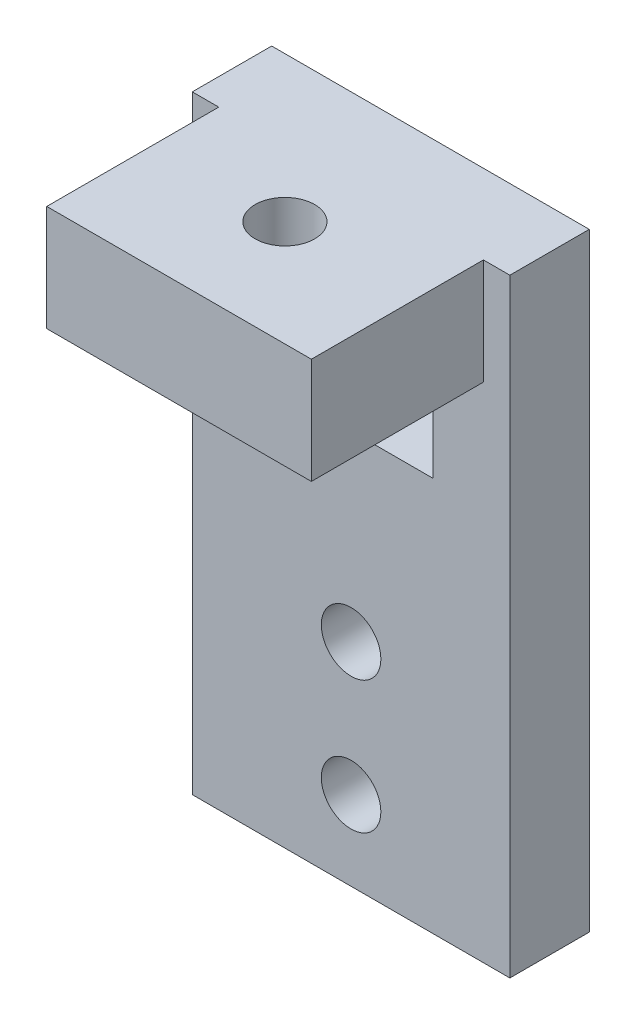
ISO-10303-21;
HEADER;
FILE_DESCRIPTION(('STEP AP214'),'2;1');
FILE_NAME('part.step','',(''),(''),'','','');
FILE_SCHEMA(('AUTOMOTIVE_DESIGN { 1 0 10303 214 1 1 1 1 }'));
ENDSEC;
DATA;
#1=APPLICATION_CONTEXT('core data for automotive mechanical design processes');
#2=APPLICATION_PROTOCOL_DEFINITION('international standard','automotive_design',2000,#1);
#3=PRODUCT_CONTEXT('',#1,'mechanical');
#4=PRODUCT('Part','Part','',(#3));
#5=PRODUCT_RELATED_PRODUCT_CATEGORY('part','',(#4));
#6=PRODUCT_DEFINITION_FORMATION('','',#4);
#7=PRODUCT_DEFINITION_CONTEXT('part definition',#1,'design');
#8=PRODUCT_DEFINITION('design','',#6,#7);
#9=PRODUCT_DEFINITION_SHAPE('','',#8);
#10=(LENGTH_UNIT() NAMED_UNIT(*) SI_UNIT(.MILLI.,.METRE.));
#11=(NAMED_UNIT(*) PLANE_ANGLE_UNIT() SI_UNIT($,.RADIAN.));
#12=(NAMED_UNIT(*) SI_UNIT($,.STERADIAN.) SOLID_ANGLE_UNIT());
#13=UNCERTAINTY_MEASURE_WITH_UNIT(LENGTH_MEASURE(1.E-05),#10,'distance_accuracy_value','');
#14=(GEOMETRIC_REPRESENTATION_CONTEXT(3) GLOBAL_UNCERTAINTY_ASSIGNED_CONTEXT((#13)) GLOBAL_UNIT_ASSIGNED_CONTEXT((#10,
#11,#12)) REPRESENTATION_CONTEXT('',''));
#15=CARTESIAN_POINT('',(0.,0.,0.));
#16=DIRECTION('',(0.,0.,1.));
#17=DIRECTION('',(1.,0.,0.));
#18=AXIS2_PLACEMENT_3D('',#15,#16,#17);
#19=CARTESIAN_POINT('',(0.,0.,6.));
#20=DIRECTION('',(0.,0.,1.));
#21=DIRECTION('',(1.,0.,0.));
#22=AXIS2_PLACEMENT_3D('',#19,#20,#21);
#23=PLANE('',#22);
#24=CARTESIAN_POINT('',(0.,-32.,6.));
#25=DIRECTION('',(0.,0.,1.));
#26=DIRECTION('',(1.,0.,0.));
#27=AXIS2_PLACEMENT_3D('',#24,#25,#26);
#28=CIRCLE('',#27,2.25);
#29=CARTESIAN_POINT('',(2.25,-32.,6.));
#30=VERTEX_POINT('',#29);
#31=EDGE_CURVE('E180',#30,#30,#28,.T.);
#32=ORIENTED_EDGE('',*,*,#31,.F.);
#33=EDGE_LOOP('',(#32));
#34=FACE_BOUND('',#33,.T.);
#35=CARTESIAN_POINT('',(0.,-22.,6.));
#36=DIRECTION('',(0.,0.,1.));
#37=DIRECTION('',(1.,0.,0.));
#38=AXIS2_PLACEMENT_3D('',#35,#36,#37);
#39=CIRCLE('',#38,2.25);
#40=CARTESIAN_POINT('',(2.25,-22.,6.));
#41=VERTEX_POINT('',#40);
#42=EDGE_CURVE('E171',#41,#41,#39,.T.);
#43=ORIENTED_EDGE('',*,*,#42,.F.);
#44=EDGE_LOOP('',(#43));
#45=FACE_BOUND('',#44,.T.);
#46=DIRECTION('',(0.,-1.,0.));
#47=VECTOR('',#46,1.);
#48=CARTESIAN_POINT('',(-6.2,0.2,6.));
#49=LINE('',#48,#47);
#50=CARTESIAN_POINT('',(-6.2,0.,6.));
#51=VERTEX_POINT('',#50);
#52=CARTESIAN_POINT('',(-6.2,-8.2,6.));
#53=VERTEX_POINT('',#52);
#54=EDGE_CURVE('E189',#51,#53,#49,.T.);
#55=ORIENTED_EDGE('',*,*,#54,.F.);
#56=DIRECTION('',(-1.,0.,0.));
#57=VECTOR('',#56,1.);
#58=CARTESIAN_POINT('',(-10.,0.,6.));
#59=LINE('',#58,#57);
#60=CARTESIAN_POINT('',(-10.,0.,6.));
#61=VERTEX_POINT('',#60);
#62=EDGE_CURVE('E11',#51,#61,#59,.T.);
#63=ORIENTED_EDGE('',*,*,#62,.T.);
#64=DIRECTION('',(0.,-1.,0.));
#65=VECTOR('',#64,1.);
#66=CARTESIAN_POINT('',(-10.,8.,6.));
#67=LINE('',#66,#65);
#68=CARTESIAN_POINT('',(-10.,8.,6.));
#69=VERTEX_POINT('',#68);
#70=EDGE_CURVE('E264',#69,#61,#67,.T.);
#71=ORIENTED_EDGE('',*,*,#70,.F.);
#72=DIRECTION('',(-1.,0.,0.));
#73=VECTOR('',#72,1.);
#74=CARTESIAN_POINT('',(12.,8.,6.));
#75=LINE('',#74,#73);
#76=CARTESIAN_POINT('',(-12.,8.,6.));
#77=VERTEX_POINT('',#76);
#78=EDGE_CURVE('E161',#69,#77,#75,.T.);
#79=ORIENTED_EDGE('',*,*,#78,.T.);
#80=DIRECTION('',(0.,-1.,0.));
#81=VECTOR('',#80,1.);
#82=CARTESIAN_POINT('',(-12.,8.,6.));
#83=LINE('',#82,#81);
#84=CARTESIAN_POINT('',(-12.,-38.,6.));
#85=VERTEX_POINT('',#84);
#86=EDGE_CURVE('E217',#77,#85,#83,.T.);
#87=ORIENTED_EDGE('',*,*,#86,.T.);
#88=DIRECTION('',(1.,0.,0.));
#89=VECTOR('',#88,1.);
#90=CARTESIAN_POINT('',(-12.,-38.,6.));
#91=LINE('',#90,#89);
#92=CARTESIAN_POINT('',(12.,-38.,6.));
#93=VERTEX_POINT('',#92);
#94=EDGE_CURVE('E220',#85,#93,#91,.T.);
#95=ORIENTED_EDGE('',*,*,#94,.T.);
#96=DIRECTION('',(0.,1.,0.));
#97=VECTOR('',#96,1.);
#98=CARTESIAN_POINT('',(12.,-38.,6.));
#99=LINE('',#98,#97);
#100=CARTESIAN_POINT('',(12.,8.,6.));
#101=VERTEX_POINT('',#100);
#102=EDGE_CURVE('E223',#93,#101,#99,.T.);
#103=ORIENTED_EDGE('',*,*,#102,.T.);
#104=CARTESIAN_POINT('',(10.,8.,6.));
#105=VERTEX_POINT('',#104);
#106=EDGE_CURVE('E225',#101,#105,#75,.T.);
#107=ORIENTED_EDGE('',*,*,#106,.T.);
#108=DIRECTION('',(0.,-1.,0.));
#109=VECTOR('',#108,1.);
#110=CARTESIAN_POINT('',(10.,8.,6.));
#111=LINE('',#110,#109);
#112=CARTESIAN_POINT('',(10.,0.,6.));
#113=VERTEX_POINT('',#112);
#114=EDGE_CURVE('E173',#105,#113,#111,.T.);
#115=ORIENTED_EDGE('',*,*,#114,.T.);
#116=CARTESIAN_POINT('',(6.2,0.,6.));
#117=VERTEX_POINT('',#116);
#118=EDGE_CURVE('E53',#113,#117,#59,.T.);
#119=ORIENTED_EDGE('',*,*,#118,.T.);
#120=DIRECTION('',(0.,1.,0.));
#121=VECTOR('',#120,1.);
#122=CARTESIAN_POINT('',(6.2,-8.2,6.));
#123=LINE('',#122,#121);
#124=CARTESIAN_POINT('',(6.2,-8.2,6.));
#125=VERTEX_POINT('',#124);
#126=EDGE_CURVE('E192',#125,#117,#123,.T.);
#127=ORIENTED_EDGE('',*,*,#126,.F.);
#128=DIRECTION('',(1.,0.,0.));
#129=VECTOR('',#128,1.);
#130=CARTESIAN_POINT('',(-6.2,-8.2,6.));
#131=LINE('',#130,#129);
#132=EDGE_CURVE('E188',#53,#125,#131,.T.);
#133=ORIENTED_EDGE('',*,*,#132,.F.);
#134=EDGE_LOOP('',(#55,#63,#71,#79,#87,#95,#103,#107,#115,#119,#127,#133));
#135=FACE_BOUND('',#134,.T.);
#136=ADVANCED_FACE('F43',(#34,#45,#135),#23,.T.);
#137=CARTESIAN_POINT('',(0.,0.,0.));
#138=DIRECTION('',(0.,0.,1.));
#139=DIRECTION('',(1.,0.,0.));
#140=AXIS2_PLACEMENT_3D('',#137,#138,#139);
#141=PLANE('',#140);
#142=DIRECTION('',(0.,-1.,0.));
#143=VECTOR('',#142,1.);
#144=CARTESIAN_POINT('',(-12.,8.,0.));
#145=LINE('',#144,#143);
#146=CARTESIAN_POINT('',(-12.,8.,0.));
#147=VERTEX_POINT('',#146);
#148=CARTESIAN_POINT('',(-12.,-38.,0.));
#149=VERTEX_POINT('',#148);
#150=EDGE_CURVE('E216',#147,#149,#145,.T.);
#151=ORIENTED_EDGE('',*,*,#150,.F.);
#152=DIRECTION('',(-1.,0.,0.));
#153=VECTOR('',#152,1.);
#154=CARTESIAN_POINT('',(12.,8.,0.));
#155=LINE('',#154,#153);
#156=CARTESIAN_POINT('',(12.,8.,0.));
#157=VERTEX_POINT('',#156);
#158=EDGE_CURVE('E221',#157,#147,#155,.T.);
#159=ORIENTED_EDGE('',*,*,#158,.F.);
#160=DIRECTION('',(0.,1.,0.));
#161=VECTOR('',#160,1.);
#162=CARTESIAN_POINT('',(12.,-38.,0.));
#163=LINE('',#162,#161);
#164=CARTESIAN_POINT('',(12.,-38.,0.));
#165=VERTEX_POINT('',#164);
#166=EDGE_CURVE('E233',#165,#157,#163,.T.);
#167=ORIENTED_EDGE('',*,*,#166,.F.);
#168=DIRECTION('',(1.,0.,0.));
#169=VECTOR('',#168,1.);
#170=CARTESIAN_POINT('',(-12.,-38.,0.));
#171=LINE('',#170,#169);
#172=EDGE_CURVE('E231',#149,#165,#171,.T.);
#173=ORIENTED_EDGE('',*,*,#172,.F.);
#174=EDGE_LOOP('',(#151,#159,#167,#173));
#175=FACE_BOUND('',#174,.T.);
#176=DIRECTION('',(0.,-1.,0.));
#177=VECTOR('',#176,1.);
#178=CARTESIAN_POINT('',(-6.2,0.2,0.));
#179=LINE('',#178,#177);
#180=CARTESIAN_POINT('',(-6.2,0.2,0.));
#181=VERTEX_POINT('',#180);
#182=CARTESIAN_POINT('',(-6.2,-8.2,0.));
#183=VERTEX_POINT('',#182);
#184=EDGE_CURVE('E68',#181,#183,#179,.T.);
#185=ORIENTED_EDGE('',*,*,#184,.T.);
#186=DIRECTION('',(1.,0.,0.));
#187=VECTOR('',#186,1.);
#188=CARTESIAN_POINT('',(-6.2,-8.2,0.));
#189=LINE('',#188,#187);
#190=CARTESIAN_POINT('',(6.2,-8.2,0.));
#191=VERTEX_POINT('',#190);
#192=EDGE_CURVE('E200',#183,#191,#189,.T.);
#193=ORIENTED_EDGE('',*,*,#192,.T.);
#194=DIRECTION('',(0.,1.,0.));
#195=VECTOR('',#194,1.);
#196=CARTESIAN_POINT('',(6.2,-8.2,0.));
#197=LINE('',#196,#195);
#198=CARTESIAN_POINT('',(6.2,0.2,0.));
#199=VERTEX_POINT('',#198);
#200=EDGE_CURVE('E203',#191,#199,#197,.T.);
#201=ORIENTED_EDGE('',*,*,#200,.T.);
#202=DIRECTION('',(-1.,0.,0.));
#203=VECTOR('',#202,1.);
#204=CARTESIAN_POINT('',(6.2,0.2,0.));
#205=LINE('',#204,#203);
#206=EDGE_CURVE('E206',#199,#181,#205,.T.);
#207=ORIENTED_EDGE('',*,*,#206,.T.);
#208=EDGE_LOOP('',(#185,#193,#201,#207));
#209=FACE_BOUND('',#208,.T.);
#210=CARTESIAN_POINT('',(0.,-32.,0.));
#211=DIRECTION('',(0.,0.,1.));
#212=DIRECTION('',(1.,0.,0.));
#213=AXIS2_PLACEMENT_3D('',#210,#211,#212);
#214=CIRCLE('',#213,2.25);
#215=CARTESIAN_POINT('',(2.25,-32.,0.));
#216=VERTEX_POINT('',#215);
#217=EDGE_CURVE('E178',#216,#216,#214,.T.);
#218=ORIENTED_EDGE('',*,*,#217,.T.);
#219=EDGE_LOOP('',(#218));
#220=FACE_BOUND('',#219,.T.);
#221=CARTESIAN_POINT('',(0.,-22.,0.));
#222=DIRECTION('',(0.,0.,1.));
#223=DIRECTION('',(1.,0.,0.));
#224=AXIS2_PLACEMENT_3D('',#221,#222,#223);
#225=CIRCLE('',#224,2.25);
#226=CARTESIAN_POINT('',(2.25,-22.,0.));
#227=VERTEX_POINT('',#226);
#228=EDGE_CURVE('E168',#227,#227,#225,.T.);
#229=ORIENTED_EDGE('',*,*,#228,.T.);
#230=EDGE_LOOP('',(#229));
#231=FACE_BOUND('',#230,.T.);
#232=ADVANCED_FACE('F255',(#175,#209,#220,#231),#141,.F.);
#233=CARTESIAN_POINT('',(-12.,8.,6.));
#234=DIRECTION('',(1.,0.,0.));
#235=DIRECTION('',(0.,0.,-1.));
#236=AXIS2_PLACEMENT_3D('',#233,#234,#235);
#237=PLANE('',#236);
#238=ORIENTED_EDGE('',*,*,#150,.T.);
#239=DIRECTION('',(0.,0.,-1.));
#240=VECTOR('',#239,1.);
#241=CARTESIAN_POINT('',(-12.,-38.,6.));
#242=LINE('',#241,#240);
#243=EDGE_CURVE('E47',#85,#149,#242,.T.);
#244=ORIENTED_EDGE('',*,*,#243,.F.);
#245=ORIENTED_EDGE('',*,*,#86,.F.);
#246=DIRECTION('',(0.,0.,-1.));
#247=VECTOR('',#246,1.);
#248=CARTESIAN_POINT('',(-12.,8.,6.));
#249=LINE('',#248,#247);
#250=EDGE_CURVE('E228',#77,#147,#249,.T.);
#251=ORIENTED_EDGE('',*,*,#250,.T.);
#252=EDGE_LOOP('',(#238,#244,#245,#251));
#253=FACE_BOUND('',#252,.T.);
#254=ADVANCED_FACE('F45',(#253),#237,.F.);
#255=CARTESIAN_POINT('',(-12.,-38.,6.));
#256=DIRECTION('',(0.,1.,0.));
#257=DIRECTION('',(0.,0.,1.));
#258=AXIS2_PLACEMENT_3D('',#255,#256,#257);
#259=PLANE('',#258);
#260=ORIENTED_EDGE('',*,*,#172,.T.);
#261=DIRECTION('',(0.,0.,-1.));
#262=VECTOR('',#261,1.);
#263=CARTESIAN_POINT('',(12.,-38.,6.));
#264=LINE('',#263,#262);
#265=EDGE_CURVE('E240',#93,#165,#264,.T.);
#266=ORIENTED_EDGE('',*,*,#265,.F.);
#267=ORIENTED_EDGE('',*,*,#94,.F.);
#268=ORIENTED_EDGE('',*,*,#243,.T.);
#269=EDGE_LOOP('',(#260,#266,#267,#268));
#270=FACE_BOUND('',#269,.T.);
#271=ADVANCED_FACE('F249',(#270),#259,.F.);
#272=CARTESIAN_POINT('',(12.,-38.,6.));
#273=DIRECTION('',(-1.,0.,0.));
#274=DIRECTION('',(0.,0.,1.));
#275=AXIS2_PLACEMENT_3D('',#272,#273,#274);
#276=PLANE('',#275);
#277=ORIENTED_EDGE('',*,*,#166,.T.);
#278=DIRECTION('',(0.,0.,-1.));
#279=VECTOR('',#278,1.);
#280=CARTESIAN_POINT('',(12.,8.,6.));
#281=LINE('',#280,#279);
#282=EDGE_CURVE('E238',#101,#157,#281,.T.);
#283=ORIENTED_EDGE('',*,*,#282,.F.);
#284=ORIENTED_EDGE('',*,*,#102,.F.);
#285=ORIENTED_EDGE('',*,*,#265,.T.);
#286=EDGE_LOOP('',(#277,#283,#284,#285));
#287=FACE_BOUND('',#286,.T.);
#288=ADVANCED_FACE('F258',(#287),#276,.F.);
#289=CARTESIAN_POINT('',(12.,8.,6.));
#290=DIRECTION('',(0.,-1.,0.));
#291=DIRECTION('',(0.,0.,-1.));
#292=AXIS2_PLACEMENT_3D('',#289,#290,#291);
#293=PLANE('',#292);
#294=ORIENTED_EDGE('',*,*,#158,.T.);
#295=ORIENTED_EDGE('',*,*,#250,.F.);
#296=ORIENTED_EDGE('',*,*,#78,.F.);
#297=DIRECTION('',(0.,0.,1.));
#298=VECTOR('',#297,1.);
#299=CARTESIAN_POINT('',(-10.,8.,19.));
#300=LINE('',#299,#298);
#301=CARTESIAN_POINT('',(-10.,8.,19.));
#302=VERTEX_POINT('',#301);
#303=EDGE_CURVE('E155',#69,#302,#300,.T.);
#304=ORIENTED_EDGE('',*,*,#303,.T.);
#305=DIRECTION('',(1.,0.,0.));
#306=VECTOR('',#305,1.);
#307=CARTESIAN_POINT('',(10.,8.,19.));
#308=LINE('',#307,#306);
#309=CARTESIAN_POINT('',(10.,8.,19.));
#310=VERTEX_POINT('',#309);
#311=EDGE_CURVE('E144',#302,#310,#308,.T.);
#312=ORIENTED_EDGE('',*,*,#311,.T.);
#313=DIRECTION('',(0.,0.,-1.));
#314=VECTOR('',#313,1.);
#315=CARTESIAN_POINT('',(10.,8.,6.));
#316=LINE('',#315,#314);
#317=EDGE_CURVE('E154',#310,#105,#316,.T.);
#318=ORIENTED_EDGE('',*,*,#317,.T.);
#319=ORIENTED_EDGE('',*,*,#106,.F.);
#320=ORIENTED_EDGE('',*,*,#282,.T.);
#321=EDGE_LOOP('',(#294,#295,#296,#304,#312,#318,#319,#320));
#322=FACE_BOUND('',#321,.T.);
#323=CARTESIAN_POINT('',(0.,8.,11.));
#324=DIRECTION('',(0.,1.,0.));
#325=DIRECTION('',(0.,0.,1.));
#326=AXIS2_PLACEMENT_3D('',#323,#324,#325);
#327=CIRCLE('',#326,2.25);
#328=CARTESIAN_POINT('',(0.,8.,13.25));
#329=VERTEX_POINT('',#328);
#330=EDGE_CURVE('E272',#329,#329,#327,.T.);
#331=ORIENTED_EDGE('',*,*,#330,.F.);
#332=EDGE_LOOP('',(#331));
#333=FACE_BOUND('',#332,.T.);
#334=ADVANCED_FACE('F158',(#322,#333),#293,.F.);
#335=CARTESIAN_POINT('',(-6.2,0.2,6.));
#336=DIRECTION('',(1.,0.,0.));
#337=DIRECTION('',(0.,0.,-1.));
#338=AXIS2_PLACEMENT_3D('',#335,#336,#337);
#339=PLANE('',#338);
#340=ORIENTED_EDGE('',*,*,#184,.F.);
#341=DIRECTION('',(0.,0.,-1.));
#342=VECTOR('',#341,1.);
#343=CARTESIAN_POINT('',(-6.2,0.2,6.));
#344=LINE('',#343,#342);
#345=CARTESIAN_POINT('',(-6.2,0.2,6.));
#346=VERTEX_POINT('',#345);
#347=EDGE_CURVE('E198',#346,#181,#344,.T.);
#348=ORIENTED_EDGE('',*,*,#347,.F.);
#349=EDGE_CURVE('E185',#346,#51,#49,.T.);
#350=ORIENTED_EDGE('',*,*,#349,.T.);
#351=ORIENTED_EDGE('',*,*,#54,.T.);
#352=DIRECTION('',(0.,0.,-1.));
#353=VECTOR('',#352,1.);
#354=CARTESIAN_POINT('',(-6.2,-8.2,6.));
#355=LINE('',#354,#353);
#356=EDGE_CURVE('E214',#53,#183,#355,.T.);
#357=ORIENTED_EDGE('',*,*,#356,.T.);
#358=EDGE_LOOP('',(#340,#348,#350,#351,#357));
#359=FACE_BOUND('',#358,.T.);
#360=ADVANCED_FACE('F283',(#359),#339,.T.);
#361=CARTESIAN_POINT('',(-6.2,-8.2,6.));
#362=DIRECTION('',(0.,1.,0.));
#363=DIRECTION('',(0.,0.,1.));
#364=AXIS2_PLACEMENT_3D('',#361,#362,#363);
#365=PLANE('',#364);
#366=ORIENTED_EDGE('',*,*,#192,.F.);
#367=ORIENTED_EDGE('',*,*,#356,.F.);
#368=ORIENTED_EDGE('',*,*,#132,.T.);
#369=DIRECTION('',(0.,0.,-1.));
#370=VECTOR('',#369,1.);
#371=CARTESIAN_POINT('',(6.2,-8.2,6.));
#372=LINE('',#371,#370);
#373=EDGE_CURVE('E212',#125,#191,#372,.T.);
#374=ORIENTED_EDGE('',*,*,#373,.T.);
#375=EDGE_LOOP('',(#366,#367,#368,#374));
#376=FACE_BOUND('',#375,.T.);
#377=ADVANCED_FACE('F289',(#376),#365,.T.);
#378=CARTESIAN_POINT('',(6.2,-8.2,6.));
#379=DIRECTION('',(-1.,0.,0.));
#380=DIRECTION('',(0.,0.,1.));
#381=AXIS2_PLACEMENT_3D('',#378,#379,#380);
#382=PLANE('',#381);
#383=ORIENTED_EDGE('',*,*,#200,.F.);
#384=ORIENTED_EDGE('',*,*,#373,.F.);
#385=ORIENTED_EDGE('',*,*,#126,.T.);
#386=CARTESIAN_POINT('',(6.2,0.2,6.));
#387=VERTEX_POINT('',#386);
#388=EDGE_CURVE('E191',#117,#387,#123,.T.);
#389=ORIENTED_EDGE('',*,*,#388,.T.);
#390=DIRECTION('',(0.,0.,-1.));
#391=VECTOR('',#390,1.);
#392=CARTESIAN_POINT('',(6.2,0.2,6.));
#393=LINE('',#392,#391);
#394=EDGE_CURVE('E210',#387,#199,#393,.T.);
#395=ORIENTED_EDGE('',*,*,#394,.T.);
#396=EDGE_LOOP('',(#383,#384,#385,#389,#395));
#397=FACE_BOUND('',#396,.T.);
#398=ADVANCED_FACE('F305',(#397),#382,.T.);
#399=CARTESIAN_POINT('',(6.2,0.2,6.));
#400=DIRECTION('',(0.,-1.,0.));
#401=DIRECTION('',(0.,0.,-1.));
#402=AXIS2_PLACEMENT_3D('',#399,#400,#401);
#403=PLANE('',#402);
#404=ORIENTED_EDGE('',*,*,#206,.F.);
#405=ORIENTED_EDGE('',*,*,#394,.F.);
#406=DIRECTION('',(-1.,0.,0.));
#407=VECTOR('',#406,1.);
#408=CARTESIAN_POINT('',(6.2,0.2,6.));
#409=LINE('',#408,#407);
#410=EDGE_CURVE('E195',#387,#346,#409,.T.);
#411=ORIENTED_EDGE('',*,*,#410,.T.);
#412=ORIENTED_EDGE('',*,*,#347,.T.);
#413=EDGE_LOOP('',(#404,#405,#411,#412));
#414=FACE_BOUND('',#413,.T.);
#415=ADVANCED_FACE('F309',(#414),#403,.T.);
#416=CARTESIAN_POINT('',(0.,-32.,6.));
#417=DIRECTION('',(0.,0.,-1.));
#418=DIRECTION('',(-1.,0.,0.));
#419=AXIS2_PLACEMENT_3D('',#416,#417,#418);
#420=CYLINDRICAL_SURFACE('',#419,2.25);
#421=ORIENTED_EDGE('',*,*,#31,.T.);
#422=EDGE_LOOP('',(#421));
#423=FACE_BOUND('',#422,.T.);
#424=ORIENTED_EDGE('',*,*,#217,.F.);
#425=EDGE_LOOP('',(#424));
#426=FACE_BOUND('',#425,.T.);
#427=ADVANCED_FACE('F313',(#423,#426),#420,.F.);
#428=CARTESIAN_POINT('',(0.,-22.,6.));
#429=DIRECTION('',(0.,0.,-1.));
#430=DIRECTION('',(-1.,0.,0.));
#431=AXIS2_PLACEMENT_3D('',#428,#429,#430);
#432=CYLINDRICAL_SURFACE('',#431,2.25);
#433=ORIENTED_EDGE('',*,*,#42,.T.);
#434=EDGE_LOOP('',(#433));
#435=FACE_BOUND('',#434,.T.);
#436=ORIENTED_EDGE('',*,*,#228,.F.);
#437=EDGE_LOOP('',(#436));
#438=FACE_BOUND('',#437,.T.);
#439=ADVANCED_FACE('F317',(#435,#438),#432,.F.);
#440=CARTESIAN_POINT('',(0.,0.,0.));
#441=DIRECTION('',(0.,-1.,0.));
#442=DIRECTION('',(0.,0.,-1.));
#443=AXIS2_PLACEMENT_3D('',#440,#441,#442);
#444=PLANE('',#443);
#445=DIRECTION('',(0.,0.,1.));
#446=VECTOR('',#445,1.);
#447=CARTESIAN_POINT('',(-10.,0.,19.));
#448=LINE('',#447,#446);
#449=CARTESIAN_POINT('',(-10.,0.,19.));
#450=VERTEX_POINT('',#449);
#451=EDGE_CURVE('E167',#61,#450,#448,.T.);
#452=ORIENTED_EDGE('',*,*,#451,.F.);
#453=ORIENTED_EDGE('',*,*,#62,.F.);
#454=EDGE_CURVE('E54',#117,#51,#59,.T.);
#455=ORIENTED_EDGE('',*,*,#454,.F.);
#456=ORIENTED_EDGE('',*,*,#118,.F.);
#457=DIRECTION('',(0.,0.,-1.));
#458=VECTOR('',#457,1.);
#459=CARTESIAN_POINT('',(10.,0.,6.));
#460=LINE('',#459,#458);
#461=CARTESIAN_POINT('',(10.,0.,19.));
#462=VERTEX_POINT('',#461);
#463=EDGE_CURVE('E268',#462,#113,#460,.T.);
#464=ORIENTED_EDGE('',*,*,#463,.F.);
#465=DIRECTION('',(1.,0.,0.));
#466=VECTOR('',#465,1.);
#467=CARTESIAN_POINT('',(10.,0.,19.));
#468=LINE('',#467,#466);
#469=EDGE_CURVE('E270',#450,#462,#468,.T.);
#470=ORIENTED_EDGE('',*,*,#469,.F.);
#471=EDGE_LOOP('',(#452,#453,#455,#456,#464,#470));
#472=FACE_BOUND('',#471,.T.);
#473=CARTESIAN_POINT('',(0.,0.,11.));
#474=DIRECTION('',(0.,1.,0.));
#475=DIRECTION('',(0.,0.,1.));
#476=AXIS2_PLACEMENT_3D('',#473,#474,#475);
#477=CIRCLE('',#476,2.25);
#478=CARTESIAN_POINT('',(0.,0.,13.25));
#479=VERTEX_POINT('',#478);
#480=EDGE_CURVE('E274',#479,#479,#477,.T.);
#481=ORIENTED_EDGE('',*,*,#480,.T.);
#482=EDGE_LOOP('',(#481));
#483=FACE_BOUND('',#482,.T.);
#484=ADVANCED_FACE('F320',(#472,#483),#444,.T.);
#485=CARTESIAN_POINT('',(-10.,8.,19.));
#486=DIRECTION('',(1.,0.,0.));
#487=DIRECTION('',(0.,0.,-1.));
#488=AXIS2_PLACEMENT_3D('',#485,#486,#487);
#489=PLANE('',#488);
#490=ORIENTED_EDGE('',*,*,#451,.T.);
#491=DIRECTION('',(0.,-1.,0.));
#492=VECTOR('',#491,1.);
#493=CARTESIAN_POINT('',(-10.,8.,19.));
#494=LINE('',#493,#492);
#495=EDGE_CURVE('E148',#302,#450,#494,.T.);
#496=ORIENTED_EDGE('',*,*,#495,.F.);
#497=ORIENTED_EDGE('',*,*,#303,.F.);
#498=ORIENTED_EDGE('',*,*,#70,.T.);
#499=EDGE_LOOP('',(#490,#496,#497,#498));
#500=FACE_BOUND('',#499,.T.);
#501=ADVANCED_FACE('F165',(#500),#489,.F.);
#502=CARTESIAN_POINT('',(10.,8.,19.));
#503=DIRECTION('',(0.,0.,-1.));
#504=DIRECTION('',(-1.,0.,0.));
#505=AXIS2_PLACEMENT_3D('',#502,#503,#504);
#506=PLANE('',#505);
#507=ORIENTED_EDGE('',*,*,#469,.T.);
#508=DIRECTION('',(0.,-1.,0.));
#509=VECTOR('',#508,1.);
#510=CARTESIAN_POINT('',(10.,8.,19.));
#511=LINE('',#510,#509);
#512=EDGE_CURVE('E151',#310,#462,#511,.T.);
#513=ORIENTED_EDGE('',*,*,#512,.F.);
#514=ORIENTED_EDGE('',*,*,#311,.F.);
#515=ORIENTED_EDGE('',*,*,#495,.T.);
#516=EDGE_LOOP('',(#507,#513,#514,#515));
#517=FACE_BOUND('',#516,.T.);
#518=ADVANCED_FACE('F146',(#517),#506,.F.);
#519=CARTESIAN_POINT('',(10.,8.,6.));
#520=DIRECTION('',(-1.,0.,0.));
#521=DIRECTION('',(0.,0.,1.));
#522=AXIS2_PLACEMENT_3D('',#519,#520,#521);
#523=PLANE('',#522);
#524=ORIENTED_EDGE('',*,*,#463,.T.);
#525=ORIENTED_EDGE('',*,*,#114,.F.);
#526=ORIENTED_EDGE('',*,*,#317,.F.);
#527=ORIENTED_EDGE('',*,*,#512,.T.);
#528=EDGE_LOOP('',(#524,#525,#526,#527));
#529=FACE_BOUND('',#528,.T.);
#530=ADVANCED_FACE('F326',(#529),#523,.F.);
#531=CARTESIAN_POINT('',(-10.,8.,6.));
#532=DIRECTION('',(0.,0.,1.));
#533=DIRECTION('',(1.,0.,0.));
#534=AXIS2_PLACEMENT_3D('',#531,#532,#533);
#535=PLANE('',#534);
#536=ORIENTED_EDGE('',*,*,#349,.F.);
#537=ORIENTED_EDGE('',*,*,#410,.F.);
#538=ORIENTED_EDGE('',*,*,#388,.F.);
#539=ORIENTED_EDGE('',*,*,#454,.T.);
#540=EDGE_LOOP('',(#536,#537,#538,#539));
#541=FACE_BOUND('',#540,.T.);
#542=ADVANCED_FACE('F329',(#541),#535,.F.);
#543=CARTESIAN_POINT('',(0.,8.,11.));
#544=DIRECTION('',(0.,-1.,0.));
#545=DIRECTION('',(0.,0.,-1.));
#546=AXIS2_PLACEMENT_3D('',#543,#544,#545);
#547=CYLINDRICAL_SURFACE('',#546,2.25);
#548=ORIENTED_EDGE('',*,*,#330,.T.);
#549=EDGE_LOOP('',(#548));
#550=FACE_BOUND('',#549,.T.);
#551=ORIENTED_EDGE('',*,*,#480,.F.);
#552=EDGE_LOOP('',(#551));
#553=FACE_BOUND('',#552,.T.);
#554=ADVANCED_FACE('F280',(#550,#553),#547,.F.);
#555=CLOSED_SHELL('',(#136,#232,#254,#271,#288,#334,#360,#377,#398,#415,#427,#439,#484,#501,
#518,#530,#542,#554));
#556=MANIFOLD_SOLID_BREP('B2',#555);
#557=ADVANCED_BREP_SHAPE_REPRESENTATION('',(#18,#556),#14);
#558=SHAPE_DEFINITION_REPRESENTATION(#9,#557);
ENDSEC;
END-ISO-10303-21;
